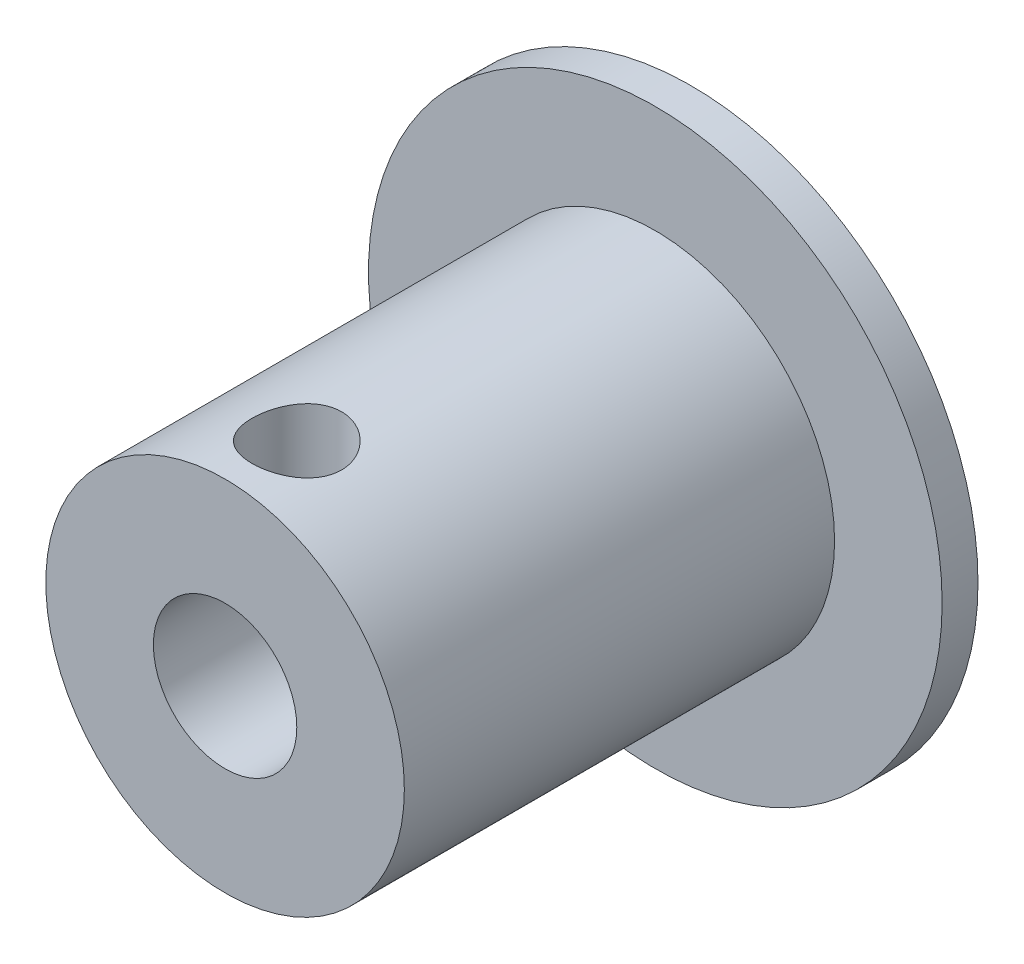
from build123d import *

# Parameters (mm, degrees)
ESQUISSE1_R                       = 8
BOSS_EXTRU_1_DEPTH                = 1
ESQUISSE2_R                       = 5
BOSS_EXTRU_2_DEPTH                = 12
DIAM_TRE_DU_PER_AGE_0_15_0_15_1_D = 4
TROU_TARAUD_M31_REACH             = 22.05
TROU_TARAUD_M31_BORE_R            = 1.25


with BuildPart() as part:
    # Esquisse1 → Boss.-Extru.1 (new body)
    with BuildSketch(Plane.XY):
        Circle(ESQUISSE1_R)
    extrude(amount=BOSS_EXTRU_1_DEPTH)

    # Esquisse2 → Boss.-Extru.2 (add)
    with BuildSketch(Plane.XY.offset(1)):
        Circle(ESQUISSE2_R)
    extrude(amount=BOSS_EXTRU_2_DEPTH)

    # Diam_tre du per_age _0.15 _0.15_1 (through all)
    with Locations(Plane(origin=(0, 0, 0), x_dir=(-1, 0, 0), z_dir=(0, 0, -1))):
        with Locations((0, 0)):
            Hole(DIAM_TRE_DU_PER_AGE_0_15_0_15_1_D / 2)

    # Trou taraud_ M31 bore → Trou taraud_ M31 (cut, up to next)
    with BuildSketch(Plane(origin=(0, 5, 0), x_dir=(1, 0, 0), z_dir=(0, 1, 0)), mode=Mode.PRIVATE) as trou_taraud_m31_sk1:
        with Locations((0, -11)):
            Circle(TROU_TARAUD_M31_BORE_R)
    trou_taraud_m31_tool1 = extrude(trou_taraud_m31_sk1.sketch, amount=-TROU_TARAUD_M31_REACH, mode=Mode.PRIVATE) & part.part
    add(trou_taraud_m31_tool1.solids().sort_by_distance((0, 5, 11))[0], mode=Mode.SUBTRACT)


solid = part.part
